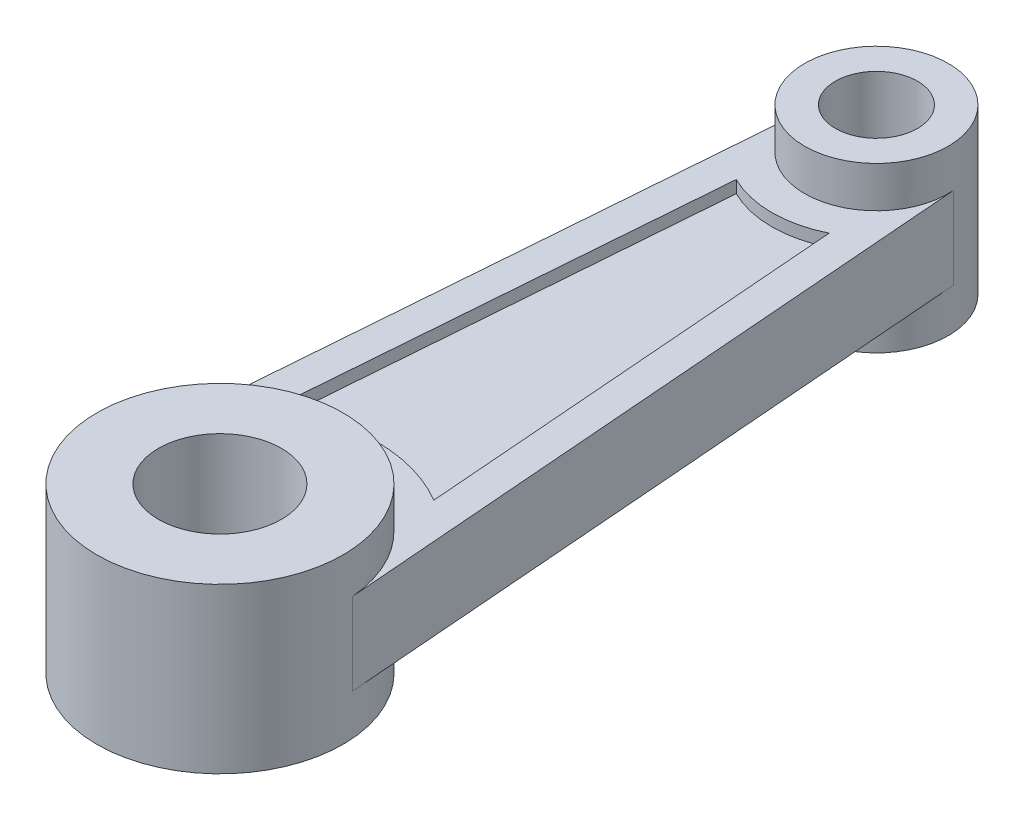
ISO-10303-21;
HEADER;
FILE_DESCRIPTION(('STEP AP214'),'2;1');
FILE_NAME('part.step','',(''),(''),'','','');
FILE_SCHEMA(('AUTOMOTIVE_DESIGN { 1 0 10303 214 1 1 1 1 }'));
ENDSEC;
DATA;
#1=APPLICATION_CONTEXT('core data for automotive mechanical design processes');
#2=APPLICATION_PROTOCOL_DEFINITION('international standard','automotive_design',2000,#1);
#3=PRODUCT_CONTEXT('',#1,'mechanical');
#4=PRODUCT('Part','Part','',(#3));
#5=PRODUCT_RELATED_PRODUCT_CATEGORY('part','',(#4));
#6=PRODUCT_DEFINITION_FORMATION('','',#4);
#7=PRODUCT_DEFINITION_CONTEXT('part definition',#1,'design');
#8=PRODUCT_DEFINITION('design','',#6,#7);
#9=PRODUCT_DEFINITION_SHAPE('','',#8);
#10=(LENGTH_UNIT() NAMED_UNIT(*) SI_UNIT(.MILLI.,.METRE.));
#11=(NAMED_UNIT(*) PLANE_ANGLE_UNIT() SI_UNIT($,.RADIAN.));
#12=(NAMED_UNIT(*) SI_UNIT($,.STERADIAN.) SOLID_ANGLE_UNIT());
#13=UNCERTAINTY_MEASURE_WITH_UNIT(LENGTH_MEASURE(1.E-05),#10,'distance_accuracy_value','');
#14=(GEOMETRIC_REPRESENTATION_CONTEXT(3) GLOBAL_UNCERTAINTY_ASSIGNED_CONTEXT((#13)) GLOBAL_UNIT_ASSIGNED_CONTEXT((#10,
#11,#12)) REPRESENTATION_CONTEXT('',''));
#15=CARTESIAN_POINT('',(0.,0.,0.));
#16=DIRECTION('',(0.,0.,1.));
#17=DIRECTION('',(1.,0.,0.));
#18=AXIS2_PLACEMENT_3D('',#15,#16,#17);
#19=CARTESIAN_POINT('',(-168.150442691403,-10.,-73.75));
#20=DIRECTION('',(0.,1.,0.));
#21=DIRECTION('',(0.,0.,1.));
#22=AXIS2_PLACEMENT_3D('',#19,#20,#21);
#23=PLANE('',#22);
#24=CARTESIAN_POINT('',(0.,-10.,-160.));
#25=DIRECTION('',(0.,1.,0.));
#26=DIRECTION('',(0.,0.,1.));
#27=AXIS2_PLACEMENT_3D('',#24,#25,#26);
#28=CIRCLE('',#27,17.5);
#29=CARTESIAN_POINT('',(-17.4465124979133,-10.,-161.3671875));
#30=VERTEX_POINT('',#29);
#31=CARTESIAN_POINT('',(17.4465124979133,-10.,-161.3671875));
#32=VERTEX_POINT('',#31);
#33=EDGE_CURVE('E201',#30,#32,#28,.T.);
#34=ORIENTED_EDGE('',*,*,#33,.T.);
#35=DIRECTION('',(0.078125,0.,0.99694357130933));
#36=VECTOR('',#35,1.);
#37=CARTESIAN_POINT('',(23.1378898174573,-10.,-88.7402175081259));
#38=LINE('',#37,#36);
#39=CARTESIAN_POINT('',(29.9083071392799,-10.,-2.34375));
#40=VERTEX_POINT('',#39);
#41=EDGE_CURVE('E207',#32,#40,#38,.T.);
#42=ORIENTED_EDGE('',*,*,#41,.T.);
#43=CARTESIAN_POINT('',(0.,-10.,0.));
#44=DIRECTION('',(0.,1.,0.));
#45=DIRECTION('',(0.,0.,1.));
#46=AXIS2_PLACEMENT_3D('',#43,#44,#45);
#47=CIRCLE('',#46,30.);
#48=CARTESIAN_POINT('',(-29.9083071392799,-10.,-2.34375));
#49=VERTEX_POINT('',#48);
#50=EDGE_CURVE('E221',#40,#49,#47,.T.);
#51=ORIENTED_EDGE('',*,*,#50,.T.);
#52=DIRECTION('',(-0.078125,0.,0.99694357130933));
#53=VECTOR('',#52,1.);
#54=CARTESIAN_POINT('',(-25.1905075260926,-10.,-62.5470139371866));
#55=LINE('',#54,#53);
#56=EDGE_CURVE('E218',#30,#49,#55,.T.);
#57=ORIENTED_EDGE('',*,*,#56,.F.);
#58=EDGE_LOOP('',(#34,#42,#51,#57));
#59=FACE_BOUND('',#58,.T.);
#60=CARTESIAN_POINT('',(0.,-10.,-160.));
#61=DIRECTION('',(0.,-1.,0.));
#62=DIRECTION('',(0.,0.,1.));
#63=AXIS2_PLACEMENT_3D('',#60,#61,#62);
#64=CIRCLE('',#63,25.5);
#65=CARTESIAN_POINT('',(11.3197388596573,-10.,-137.150196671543));
#66=VERTEX_POINT('',#65);
#67=CARTESIAN_POINT('',(-11.3197388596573,-10.,-137.150196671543));
#68=VERTEX_POINT('',#67);
#69=EDGE_CURVE('E49',#66,#68,#64,.T.);
#70=ORIENTED_EDGE('',*,*,#69,.T.);
#71=DIRECTION('',(-0.0781249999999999,0.,0.996943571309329));
#72=VECTOR('',#71,1.);
#73=CARTESIAN_POINT('',(-11.3197388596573,-10.,-137.150196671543));
#74=LINE('',#73,#72);
#75=CARTESIAN_POINT('',(-19.5121439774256,-10.,-32.6079167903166));
#76=VERTEX_POINT('',#75);
#77=EDGE_CURVE('E143',#68,#76,#74,.T.);
#78=ORIENTED_EDGE('',*,*,#77,.T.);
#79=CARTESIAN_POINT('',(0.,-10.,0.));
#80=DIRECTION('',(0.,-1.,0.));
#81=DIRECTION('',(0.,0.,1.));
#82=AXIS2_PLACEMENT_3D('',#79,#80,#81);
#83=CIRCLE('',#82,38.);
#84=CARTESIAN_POINT('',(19.5121439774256,-10.,-32.6079167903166));
#85=VERTEX_POINT('',#84);
#86=EDGE_CURVE('E146',#76,#85,#83,.T.);
#87=ORIENTED_EDGE('',*,*,#86,.T.);
#88=DIRECTION('',(-0.078125,0.,-0.996943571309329));
#89=VECTOR('',#88,1.);
#90=CARTESIAN_POINT('',(19.5121439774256,-10.,-32.6079167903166));
#91=LINE('',#90,#89);
#92=EDGE_CURVE('E152',#85,#66,#91,.T.);
#93=ORIENTED_EDGE('',*,*,#92,.T.);
#94=EDGE_LOOP('',(#70,#78,#87,#93));
#95=FACE_BOUND('',#94,.T.);
#96=ADVANCED_FACE('F32',(#59,#95),#23,.F.);
#97=CARTESIAN_POINT('',(0.,20.,0.));
#98=DIRECTION('',(0.,-1.,0.));
#99=DIRECTION('',(0.,0.,-1.));
#100=AXIS2_PLACEMENT_3D('',#97,#98,#99);
#101=CYLINDRICAL_SURFACE('',#100,15.);
#102=CARTESIAN_POINT('',(0.,20.,0.));
#103=DIRECTION('',(0.,1.,0.));
#104=DIRECTION('',(0.,0.,1.));
#105=AXIS2_PLACEMENT_3D('',#102,#103,#104);
#106=CIRCLE('',#105,15.);
#107=CARTESIAN_POINT('',(0.,20.,15.));
#108=VERTEX_POINT('',#107);
#109=EDGE_CURVE('E41',#108,#108,#106,.T.);
#110=ORIENTED_EDGE('',*,*,#109,.T.);
#111=EDGE_LOOP('',(#110));
#112=FACE_BOUND('',#111,.T.);
#113=CARTESIAN_POINT('',(0.,-20.,0.));
#114=DIRECTION('',(0.,1.,0.));
#115=DIRECTION('',(0.,0.,1.));
#116=AXIS2_PLACEMENT_3D('',#113,#114,#115);
#117=CIRCLE('',#116,15.);
#118=CARTESIAN_POINT('',(0.,-20.,15.));
#119=VERTEX_POINT('',#118);
#120=EDGE_CURVE('E235',#119,#119,#117,.T.);
#121=ORIENTED_EDGE('',*,*,#120,.F.);
#122=EDGE_LOOP('',(#121));
#123=FACE_BOUND('',#122,.T.);
#124=ADVANCED_FACE('F34',(#112,#123),#101,.F.);
#125=CARTESIAN_POINT('',(0.,20.,0.));
#126=DIRECTION('',(0.,-1.,0.));
#127=DIRECTION('',(0.,0.,-1.));
#128=AXIS2_PLACEMENT_3D('',#125,#126,#127);
#129=CYLINDRICAL_SURFACE('',#128,30.);
#130=DIRECTION('',(0.,-1.,0.));
#131=VECTOR('',#130,1.);
#132=CARTESIAN_POINT('',(29.9083071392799,10.,-2.34375000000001));
#133=LINE('',#132,#131);
#134=CARTESIAN_POINT('',(29.9083071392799,10.,-2.34375));
#135=VERTEX_POINT('',#134);
#136=EDGE_CURVE('E227',#135,#40,#133,.T.);
#137=ORIENTED_EDGE('',*,*,#136,.F.);
#138=CARTESIAN_POINT('',(0.,10.,0.));
#139=DIRECTION('',(0.,1.,0.));
#140=DIRECTION('',(0.,0.,1.));
#141=AXIS2_PLACEMENT_3D('',#138,#139,#140);
#142=CIRCLE('',#141,30.);
#143=CARTESIAN_POINT('',(-29.9083071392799,10.,-2.34375));
#144=VERTEX_POINT('',#143);
#145=EDGE_CURVE('E210',#135,#144,#142,.T.);
#146=ORIENTED_EDGE('',*,*,#145,.T.);
#147=DIRECTION('',(0.,-1.,0.));
#148=VECTOR('',#147,1.);
#149=CARTESIAN_POINT('',(-29.9083071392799,10.,-2.34375));
#150=LINE('',#149,#148);
#151=EDGE_CURVE('E230',#144,#49,#150,.T.);
#152=ORIENTED_EDGE('',*,*,#151,.T.);
#153=ORIENTED_EDGE('',*,*,#50,.F.);
#154=EDGE_LOOP('',(#137,#146,#152,#153));
#155=FACE_BOUND('',#154,.T.);
#156=CARTESIAN_POINT('',(0.,20.,0.));
#157=DIRECTION('',(0.,1.,0.));
#158=DIRECTION('',(0.,0.,1.));
#159=AXIS2_PLACEMENT_3D('',#156,#157,#158);
#160=CIRCLE('',#159,30.);
#161=CARTESIAN_POINT('',(0.,20.,30.));
#162=VERTEX_POINT('',#161);
#163=EDGE_CURVE('E11',#162,#162,#160,.T.);
#164=ORIENTED_EDGE('',*,*,#163,.F.);
#165=EDGE_LOOP('',(#164));
#166=FACE_BOUND('',#165,.T.);
#167=CARTESIAN_POINT('',(0.,-20.,0.));
#168=DIRECTION('',(0.,1.,0.));
#169=DIRECTION('',(0.,0.,1.));
#170=AXIS2_PLACEMENT_3D('',#167,#168,#169);
#171=CIRCLE('',#170,30.);
#172=CARTESIAN_POINT('',(0.,-20.,30.));
#173=VERTEX_POINT('',#172);
#174=EDGE_CURVE('E36',#173,#173,#171,.T.);
#175=ORIENTED_EDGE('',*,*,#174,.T.);
#176=EDGE_LOOP('',(#175));
#177=FACE_BOUND('',#176,.T.);
#178=ADVANCED_FACE('F243',(#155,#166,#177),#129,.T.);
#179=CARTESIAN_POINT('',(-168.150442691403,20.,-73.75));
#180=DIRECTION('',(0.,1.,0.));
#181=DIRECTION('',(0.,0.,1.));
#182=AXIS2_PLACEMENT_3D('',#179,#180,#181);
#183=PLANE('',#182);
#184=ORIENTED_EDGE('',*,*,#109,.F.);
#185=EDGE_LOOP('',(#184));
#186=FACE_BOUND('',#185,.T.);
#187=ORIENTED_EDGE('',*,*,#163,.T.);
#188=EDGE_LOOP('',(#187));
#189=FACE_BOUND('',#188,.T.);
#190=ADVANCED_FACE('F248',(#186,#189),#183,.T.);
#191=CARTESIAN_POINT('',(-168.150442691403,-20.,-73.75));
#192=DIRECTION('',(0.,1.,0.));
#193=DIRECTION('',(0.,0.,1.));
#194=AXIS2_PLACEMENT_3D('',#191,#192,#193);
#195=PLANE('',#194);
#196=ORIENTED_EDGE('',*,*,#120,.T.);
#197=EDGE_LOOP('',(#196));
#198=FACE_BOUND('',#197,.T.);
#199=ORIENTED_EDGE('',*,*,#174,.F.);
#200=EDGE_LOOP('',(#199));
#201=FACE_BOUND('',#200,.T.);
#202=ADVANCED_FACE('F245',(#198,#201),#195,.F.);
#203=CARTESIAN_POINT('',(-25.1905075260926,10.,-62.5470139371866));
#204=DIRECTION('',(0.996943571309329,0.,0.078125));
#205=DIRECTION('',(0.078125,0.,-0.996943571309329));
#206=AXIS2_PLACEMENT_3D('',#203,#204,#205);
#207=PLANE('',#206);
#208=ORIENTED_EDGE('',*,*,#56,.T.);
#209=ORIENTED_EDGE('',*,*,#151,.F.);
#210=DIRECTION('',(-0.078125,0.,0.99694357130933));
#211=VECTOR('',#210,1.);
#212=CARTESIAN_POINT('',(-25.1905075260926,10.,-62.5470139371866));
#213=LINE('',#212,#211);
#214=CARTESIAN_POINT('',(-17.4465124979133,10.,-161.3671875));
#215=VERTEX_POINT('',#214);
#216=EDGE_CURVE('E206',#215,#144,#213,.T.);
#217=ORIENTED_EDGE('',*,*,#216,.F.);
#218=DIRECTION('',(0.,-1.,0.));
#219=VECTOR('',#218,1.);
#220=CARTESIAN_POINT('',(-17.4465124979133,10.,-161.3671875));
#221=LINE('',#220,#219);
#222=EDGE_CURVE('E232',#215,#30,#221,.T.);
#223=ORIENTED_EDGE('',*,*,#222,.T.);
#224=EDGE_LOOP('',(#208,#209,#217,#223));
#225=FACE_BOUND('',#224,.T.);
#226=ADVANCED_FACE('F247',(#225),#207,.F.);
#227=CARTESIAN_POINT('',(23.1378898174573,10.,-88.7402175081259));
#228=DIRECTION('',(0.996943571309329,0.,-0.078125));
#229=DIRECTION('',(-0.078125,0.,-0.996943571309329));
#230=AXIS2_PLACEMENT_3D('',#227,#228,#229);
#231=PLANE('',#230);
#232=ORIENTED_EDGE('',*,*,#41,.F.);
#233=DIRECTION('',(0.,-1.,0.));
#234=VECTOR('',#233,1.);
#235=CARTESIAN_POINT('',(17.4465124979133,10.,-161.3671875));
#236=LINE('',#235,#234);
#237=CARTESIAN_POINT('',(17.4465124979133,10.,-161.3671875));
#238=VERTEX_POINT('',#237);
#239=EDGE_CURVE('E215',#238,#32,#236,.T.);
#240=ORIENTED_EDGE('',*,*,#239,.F.);
#241=DIRECTION('',(0.078125,0.,0.99694357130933));
#242=VECTOR('',#241,1.);
#243=CARTESIAN_POINT('',(23.1378898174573,10.,-88.7402175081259));
#244=LINE('',#243,#242);
#245=EDGE_CURVE('E212',#238,#135,#244,.T.);
#246=ORIENTED_EDGE('',*,*,#245,.T.);
#247=ORIENTED_EDGE('',*,*,#136,.T.);
#248=EDGE_LOOP('',(#232,#240,#246,#247));
#249=FACE_BOUND('',#248,.T.);
#250=ADVANCED_FACE('F254',(#249),#231,.T.);
#251=CARTESIAN_POINT('',(-168.150442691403,10.,-73.75));
#252=DIRECTION('',(0.,1.,0.));
#253=DIRECTION('',(0.,0.,1.));
#254=AXIS2_PLACEMENT_3D('',#251,#252,#253);
#255=PLANE('',#254);
#256=CARTESIAN_POINT('',(0.,10.,-160.));
#257=DIRECTION('',(0.,-1.,0.));
#258=DIRECTION('',(0.,0.,1.));
#259=AXIS2_PLACEMENT_3D('',#256,#257,#258);
#260=CIRCLE('',#259,25.5);
#261=CARTESIAN_POINT('',(11.3197388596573,10.,-137.150196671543));
#262=VERTEX_POINT('',#261);
#263=CARTESIAN_POINT('',(-11.3197388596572,10.,-137.150196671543));
#264=VERTEX_POINT('',#263);
#265=EDGE_CURVE('E57',#262,#264,#260,.T.);
#266=ORIENTED_EDGE('',*,*,#265,.F.);
#267=DIRECTION('',(-0.078125,0.,-0.996943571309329));
#268=VECTOR('',#267,1.);
#269=CARTESIAN_POINT('',(19.5121439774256,10.,-32.6079167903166));
#270=LINE('',#269,#268);
#271=CARTESIAN_POINT('',(19.5121439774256,10.,-32.6079167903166));
#272=VERTEX_POINT('',#271);
#273=EDGE_CURVE('E165',#272,#262,#270,.T.);
#274=ORIENTED_EDGE('',*,*,#273,.F.);
#275=CARTESIAN_POINT('',(0.,10.,0.));
#276=DIRECTION('',(0.,-1.,0.));
#277=DIRECTION('',(0.,0.,1.));
#278=AXIS2_PLACEMENT_3D('',#275,#276,#277);
#279=CIRCLE('',#278,38.);
#280=CARTESIAN_POINT('',(-19.5121439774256,10.,-32.6079167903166));
#281=VERTEX_POINT('',#280);
#282=EDGE_CURVE('E179',#281,#272,#279,.T.);
#283=ORIENTED_EDGE('',*,*,#282,.F.);
#284=DIRECTION('',(-0.0781249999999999,0.,0.996943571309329));
#285=VECTOR('',#284,1.);
#286=CARTESIAN_POINT('',(-11.3197388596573,10.,-137.150196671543));
#287=LINE('',#286,#285);
#288=EDGE_CURVE('E176',#264,#281,#287,.T.);
#289=ORIENTED_EDGE('',*,*,#288,.F.);
#290=EDGE_LOOP('',(#266,#274,#283,#289));
#291=FACE_BOUND('',#290,.T.);
#292=CARTESIAN_POINT('',(0.,10.,-160.));
#293=DIRECTION('',(0.,1.,0.));
#294=DIRECTION('',(0.,0.,1.));
#295=AXIS2_PLACEMENT_3D('',#292,#293,#294);
#296=CIRCLE('',#295,17.5);
#297=EDGE_CURVE('E204',#215,#238,#296,.T.);
#298=ORIENTED_EDGE('',*,*,#297,.F.);
#299=ORIENTED_EDGE('',*,*,#216,.T.);
#300=ORIENTED_EDGE('',*,*,#145,.F.);
#301=ORIENTED_EDGE('',*,*,#245,.F.);
#302=EDGE_LOOP('',(#298,#299,#300,#301));
#303=FACE_BOUND('',#302,.T.);
#304=ADVANCED_FACE('F269',(#291,#303),#255,.T.);
#305=CARTESIAN_POINT('',(0.,20.,-160.));
#306=DIRECTION('',(0.,-1.,0.));
#307=DIRECTION('',(0.,0.,-1.));
#308=AXIS2_PLACEMENT_3D('',#305,#306,#307);
#309=CYLINDRICAL_SURFACE('',#308,17.5);
#310=ORIENTED_EDGE('',*,*,#297,.T.);
#311=ORIENTED_EDGE('',*,*,#239,.T.);
#312=ORIENTED_EDGE('',*,*,#33,.F.);
#313=ORIENTED_EDGE('',*,*,#222,.F.);
#314=EDGE_LOOP('',(#310,#311,#312,#313));
#315=FACE_BOUND('',#314,.T.);
#316=CARTESIAN_POINT('',(0.,20.,-160.));
#317=DIRECTION('',(0.,1.,0.));
#318=DIRECTION('',(0.,0.,1.));
#319=AXIS2_PLACEMENT_3D('',#316,#317,#318);
#320=CIRCLE('',#319,17.5);
#321=CARTESIAN_POINT('',(0.,20.,-142.5));
#322=VERTEX_POINT('',#321);
#323=EDGE_CURVE('E195',#322,#322,#320,.T.);
#324=ORIENTED_EDGE('',*,*,#323,.F.);
#325=EDGE_LOOP('',(#324));
#326=FACE_BOUND('',#325,.T.);
#327=CARTESIAN_POINT('',(0.,-20.,-160.));
#328=DIRECTION('',(0.,1.,0.));
#329=DIRECTION('',(0.,0.,1.));
#330=AXIS2_PLACEMENT_3D('',#327,#328,#329);
#331=CIRCLE('',#330,17.5);
#332=CARTESIAN_POINT('',(0.,-20.,-142.5));
#333=VERTEX_POINT('',#332);
#334=EDGE_CURVE('E198',#333,#333,#331,.T.);
#335=ORIENTED_EDGE('',*,*,#334,.T.);
#336=EDGE_LOOP('',(#335));
#337=FACE_BOUND('',#336,.T.);
#338=ADVANCED_FACE('F276',(#315,#326,#337),#309,.T.);
#339=CARTESIAN_POINT('',(0.,20.,-160.));
#340=DIRECTION('',(0.,1.,0.));
#341=DIRECTION('',(0.,0.,1.));
#342=AXIS2_PLACEMENT_3D('',#339,#340,#341);
#343=PLANE('',#342);
#344=CARTESIAN_POINT('',(0.,20.,-160.));
#345=DIRECTION('',(0.,1.,0.));
#346=DIRECTION('',(0.,0.,1.));
#347=AXIS2_PLACEMENT_3D('',#344,#345,#346);
#348=CIRCLE('',#347,10.);
#349=CARTESIAN_POINT('',(0.,20.,-150.));
#350=VERTEX_POINT('',#349);
#351=EDGE_CURVE('E186',#350,#350,#348,.T.);
#352=ORIENTED_EDGE('',*,*,#351,.F.);
#353=EDGE_LOOP('',(#352));
#354=FACE_BOUND('',#353,.T.);
#355=ORIENTED_EDGE('',*,*,#323,.T.);
#356=EDGE_LOOP('',(#355));
#357=FACE_BOUND('',#356,.T.);
#358=ADVANCED_FACE('F319',(#354,#357),#343,.T.);
#359=CARTESIAN_POINT('',(0.,-20.,-160.));
#360=DIRECTION('',(0.,1.,0.));
#361=DIRECTION('',(0.,0.,1.));
#362=AXIS2_PLACEMENT_3D('',#359,#360,#361);
#363=PLANE('',#362);
#364=CARTESIAN_POINT('',(0.,-20.,-160.));
#365=DIRECTION('',(0.,1.,0.));
#366=DIRECTION('',(0.,0.,1.));
#367=AXIS2_PLACEMENT_3D('',#364,#365,#366);
#368=CIRCLE('',#367,10.);
#369=CARTESIAN_POINT('',(0.,-20.,-150.));
#370=VERTEX_POINT('',#369);
#371=EDGE_CURVE('E192',#370,#370,#368,.T.);
#372=ORIENTED_EDGE('',*,*,#371,.T.);
#373=EDGE_LOOP('',(#372));
#374=FACE_BOUND('',#373,.T.);
#375=ORIENTED_EDGE('',*,*,#334,.F.);
#376=EDGE_LOOP('',(#375));
#377=FACE_BOUND('',#376,.T.);
#378=ADVANCED_FACE('F327',(#374,#377),#363,.F.);
#379=CARTESIAN_POINT('',(0.,-20.,-160.));
#380=DIRECTION('',(0.,1.,0.));
#381=DIRECTION('',(0.,0.,1.));
#382=AXIS2_PLACEMENT_3D('',#379,#380,#381);
#383=CYLINDRICAL_SURFACE('',#382,10.);
#384=ORIENTED_EDGE('',*,*,#371,.F.);
#385=EDGE_LOOP('',(#384));
#386=FACE_BOUND('',#385,.T.);
#387=ORIENTED_EDGE('',*,*,#351,.T.);
#388=EDGE_LOOP('',(#387));
#389=FACE_BOUND('',#388,.T.);
#390=ADVANCED_FACE('F335',(#386,#389),#383,.F.);
#391=CARTESIAN_POINT('',(0.,7.,-160.));
#392=DIRECTION('',(0.,1.,0.));
#393=DIRECTION('',(0.,0.,1.));
#394=AXIS2_PLACEMENT_3D('',#391,#392,#393);
#395=CYLINDRICAL_SURFACE('',#394,25.5);
#396=ORIENTED_EDGE('',*,*,#265,.T.);
#397=DIRECTION('',(0.,1.,0.));
#398=VECTOR('',#397,1.);
#399=CARTESIAN_POINT('',(-11.3197388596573,7.,-137.150196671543));
#400=LINE('',#399,#398);
#401=CARTESIAN_POINT('',(-11.3197388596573,7.,-137.150196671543));
#402=VERTEX_POINT('',#401);
#403=EDGE_CURVE('E174',#402,#264,#400,.T.);
#404=ORIENTED_EDGE('',*,*,#403,.F.);
#405=CARTESIAN_POINT('',(0.,7.,-160.));
#406=DIRECTION('',(0.,-1.,0.));
#407=DIRECTION('',(0.,0.,1.));
#408=AXIS2_PLACEMENT_3D('',#405,#406,#407);
#409=CIRCLE('',#408,25.5);
#410=CARTESIAN_POINT('',(11.3197388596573,7.,-137.150196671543));
#411=VERTEX_POINT('',#410);
#412=EDGE_CURVE('E161',#411,#402,#409,.T.);
#413=ORIENTED_EDGE('',*,*,#412,.F.);
#414=DIRECTION('',(0.,1.,0.));
#415=VECTOR('',#414,1.);
#416=CARTESIAN_POINT('',(11.3197388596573,7.,-137.150196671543));
#417=LINE('',#416,#415);
#418=EDGE_CURVE('E184',#411,#262,#417,.T.);
#419=ORIENTED_EDGE('',*,*,#418,.T.);
#420=EDGE_LOOP('',(#396,#404,#413,#419));
#421=FACE_BOUND('',#420,.T.);
#422=ADVANCED_FACE('F361',(#421),#395,.T.);
#423=CARTESIAN_POINT('',(19.5121439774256,7.,-32.6079167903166));
#424=DIRECTION('',(0.996943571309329,0.,-0.078125));
#425=DIRECTION('',(-0.078125,0.,-0.99694357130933));
#426=AXIS2_PLACEMENT_3D('',#423,#424,#425);
#427=PLANE('',#426);
#428=ORIENTED_EDGE('',*,*,#273,.T.);
#429=ORIENTED_EDGE('',*,*,#418,.F.);
#430=DIRECTION('',(-0.078125,0.,-0.996943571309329));
#431=VECTOR('',#430,1.);
#432=CARTESIAN_POINT('',(19.5121439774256,7.,-32.6079167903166));
#433=LINE('',#432,#431);
#434=CARTESIAN_POINT('',(19.5121439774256,7.,-32.6079167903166));
#435=VERTEX_POINT('',#434);
#436=EDGE_CURVE('E171',#435,#411,#433,.T.);
#437=ORIENTED_EDGE('',*,*,#436,.F.);
#438=DIRECTION('',(0.,1.,0.));
#439=VECTOR('',#438,1.);
#440=CARTESIAN_POINT('',(19.5121439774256,7.,-32.6079167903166));
#441=LINE('',#440,#439);
#442=EDGE_CURVE('E187',#435,#272,#441,.T.);
#443=ORIENTED_EDGE('',*,*,#442,.T.);
#444=EDGE_LOOP('',(#428,#429,#437,#443));
#445=FACE_BOUND('',#444,.T.);
#446=ADVANCED_FACE('F369',(#445),#427,.F.);
#447=CARTESIAN_POINT('',(0.,7.,0.));
#448=DIRECTION('',(0.,1.,0.));
#449=DIRECTION('',(0.,0.,1.));
#450=AXIS2_PLACEMENT_3D('',#447,#448,#449);
#451=CYLINDRICAL_SURFACE('',#450,38.);
#452=ORIENTED_EDGE('',*,*,#282,.T.);
#453=ORIENTED_EDGE('',*,*,#442,.F.);
#454=CARTESIAN_POINT('',(0.,7.,0.));
#455=DIRECTION('',(0.,-1.,0.));
#456=DIRECTION('',(0.,0.,1.));
#457=AXIS2_PLACEMENT_3D('',#454,#455,#456);
#458=CIRCLE('',#457,38.);
#459=CARTESIAN_POINT('',(-19.5121439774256,7.,-32.6079167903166));
#460=VERTEX_POINT('',#459);
#461=EDGE_CURVE('E168',#460,#435,#458,.T.);
#462=ORIENTED_EDGE('',*,*,#461,.F.);
#463=DIRECTION('',(0.,1.,0.));
#464=VECTOR('',#463,1.);
#465=CARTESIAN_POINT('',(-19.5121439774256,7.,-32.6079167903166));
#466=LINE('',#465,#464);
#467=EDGE_CURVE('E189',#460,#281,#466,.T.);
#468=ORIENTED_EDGE('',*,*,#467,.T.);
#469=EDGE_LOOP('',(#452,#453,#462,#468));
#470=FACE_BOUND('',#469,.T.);
#471=ADVANCED_FACE('F377',(#470),#451,.T.);
#472=CARTESIAN_POINT('',(-11.3197388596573,7.,-137.150196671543));
#473=DIRECTION('',(-0.99694357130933,0.,-0.0781249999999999));
#474=DIRECTION('',(-0.0781249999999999,0.,0.99694357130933));
#475=AXIS2_PLACEMENT_3D('',#472,#473,#474);
#476=PLANE('',#475);
#477=ORIENTED_EDGE('',*,*,#288,.T.);
#478=ORIENTED_EDGE('',*,*,#467,.F.);
#479=DIRECTION('',(-0.0781249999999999,0.,0.996943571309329));
#480=VECTOR('',#479,1.);
#481=CARTESIAN_POINT('',(-11.3197388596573,7.,-137.150196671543));
#482=LINE('',#481,#480);
#483=EDGE_CURVE('E164',#402,#460,#482,.T.);
#484=ORIENTED_EDGE('',*,*,#483,.F.);
#485=ORIENTED_EDGE('',*,*,#403,.T.);
#486=EDGE_LOOP('',(#477,#478,#484,#485));
#487=FACE_BOUND('',#486,.T.);
#488=ADVANCED_FACE('F386',(#487),#476,.F.);
#489=CARTESIAN_POINT('',(0.,7.,-160.));
#490=DIRECTION('',(0.,1.,0.));
#491=DIRECTION('',(0.,0.,1.));
#492=AXIS2_PLACEMENT_3D('',#489,#490,#491);
#493=PLANE('',#492);
#494=ORIENTED_EDGE('',*,*,#412,.T.);
#495=ORIENTED_EDGE('',*,*,#483,.T.);
#496=ORIENTED_EDGE('',*,*,#461,.T.);
#497=ORIENTED_EDGE('',*,*,#436,.T.);
#498=EDGE_LOOP('',(#494,#495,#496,#497));
#499=FACE_BOUND('',#498,.T.);
#500=ADVANCED_FACE('F395',(#499),#493,.T.);
#501=CARTESIAN_POINT('',(0.,-7.,-160.));
#502=DIRECTION('',(0.,-1.,0.));
#503=DIRECTION('',(0.,0.,-1.));
#504=AXIS2_PLACEMENT_3D('',#501,#502,#503);
#505=CYLINDRICAL_SURFACE('',#504,25.5);
#506=ORIENTED_EDGE('',*,*,#69,.F.);
#507=DIRECTION('',(0.,-1.,0.));
#508=VECTOR('',#507,1.);
#509=CARTESIAN_POINT('',(11.3197388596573,-7.,-137.150196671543));
#510=LINE('',#509,#508);
#511=CARTESIAN_POINT('',(11.3197388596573,-7.,-137.150196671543));
#512=VERTEX_POINT('',#511);
#513=EDGE_CURVE('E128',#512,#66,#510,.T.);
#514=ORIENTED_EDGE('',*,*,#513,.F.);
#515=CARTESIAN_POINT('',(0.,-7.,-160.));
#516=DIRECTION('',(0.,-1.,0.));
#517=DIRECTION('',(0.,0.,1.));
#518=AXIS2_PLACEMENT_3D('',#515,#516,#517);
#519=CIRCLE('',#518,25.5);
#520=CARTESIAN_POINT('',(-11.3197388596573,-7.,-137.150196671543));
#521=VERTEX_POINT('',#520);
#522=EDGE_CURVE('E135',#512,#521,#519,.T.);
#523=ORIENTED_EDGE('',*,*,#522,.T.);
#524=DIRECTION('',(0.,-1.,0.));
#525=VECTOR('',#524,1.);
#526=CARTESIAN_POINT('',(-11.3197388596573,-7.,-137.150196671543));
#527=LINE('',#526,#525);
#528=EDGE_CURVE('E156',#521,#68,#527,.T.);
#529=ORIENTED_EDGE('',*,*,#528,.T.);
#530=EDGE_LOOP('',(#506,#514,#523,#529));
#531=FACE_BOUND('',#530,.T.);
#532=ADVANCED_FACE('F138',(#531),#505,.T.);
#533=CARTESIAN_POINT('',(-11.3197388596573,-7.,-137.150196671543));
#534=DIRECTION('',(0.99694357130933,0.,0.0781249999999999));
#535=DIRECTION('',(0.0781249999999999,0.,-0.99694357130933));
#536=AXIS2_PLACEMENT_3D('',#533,#534,#535);
#537=PLANE('',#536);
#538=ORIENTED_EDGE('',*,*,#77,.F.);
#539=ORIENTED_EDGE('',*,*,#528,.F.);
#540=DIRECTION('',(-0.0781249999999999,0.,0.996943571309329));
#541=VECTOR('',#540,1.);
#542=CARTESIAN_POINT('',(-11.3197388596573,-7.,-137.150196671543));
#543=LINE('',#542,#541);
#544=CARTESIAN_POINT('',(-19.5121439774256,-7.,-32.6079167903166));
#545=VERTEX_POINT('',#544);
#546=EDGE_CURVE('E140',#521,#545,#543,.T.);
#547=ORIENTED_EDGE('',*,*,#546,.T.);
#548=DIRECTION('',(0.,-1.,0.));
#549=VECTOR('',#548,1.);
#550=CARTESIAN_POINT('',(-19.5121439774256,-7.,-32.6079167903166));
#551=LINE('',#550,#549);
#552=EDGE_CURVE('E158',#545,#76,#551,.T.);
#553=ORIENTED_EDGE('',*,*,#552,.T.);
#554=EDGE_LOOP('',(#538,#539,#547,#553));
#555=FACE_BOUND('',#554,.T.);
#556=ADVANCED_FACE('F419',(#555),#537,.T.);
#557=CARTESIAN_POINT('',(0.,-7.,0.));
#558=DIRECTION('',(0.,-1.,0.));
#559=DIRECTION('',(0.,0.,-1.));
#560=AXIS2_PLACEMENT_3D('',#557,#558,#559);
#561=CYLINDRICAL_SURFACE('',#560,38.);
#562=ORIENTED_EDGE('',*,*,#86,.F.);
#563=ORIENTED_EDGE('',*,*,#552,.F.);
#564=CARTESIAN_POINT('',(0.,-7.,0.));
#565=DIRECTION('',(0.,-1.,0.));
#566=DIRECTION('',(0.,0.,1.));
#567=AXIS2_PLACEMENT_3D('',#564,#565,#566);
#568=CIRCLE('',#567,38.);
#569=CARTESIAN_POINT('',(19.5121439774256,-7.,-32.6079167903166));
#570=VERTEX_POINT('',#569);
#571=EDGE_CURVE('E134',#545,#570,#568,.T.);
#572=ORIENTED_EDGE('',*,*,#571,.T.);
#573=DIRECTION('',(0.,-1.,0.));
#574=VECTOR('',#573,1.);
#575=CARTESIAN_POINT('',(19.5121439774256,-7.,-32.6079167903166));
#576=LINE('',#575,#574);
#577=EDGE_CURVE('E130',#570,#85,#576,.T.);
#578=ORIENTED_EDGE('',*,*,#577,.T.);
#579=EDGE_LOOP('',(#562,#563,#572,#578));
#580=FACE_BOUND('',#579,.T.);
#581=ADVANCED_FACE('F427',(#580),#561,.T.);
#582=CARTESIAN_POINT('',(19.5121439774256,-7.,-32.6079167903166));
#583=DIRECTION('',(-0.996943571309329,0.,0.078125));
#584=DIRECTION('',(0.078125,0.,0.99694357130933));
#585=AXIS2_PLACEMENT_3D('',#582,#583,#584);
#586=PLANE('',#585);
#587=ORIENTED_EDGE('',*,*,#92,.F.);
#588=ORIENTED_EDGE('',*,*,#577,.F.);
#589=DIRECTION('',(-0.078125,0.,-0.996943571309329));
#590=VECTOR('',#589,1.);
#591=CARTESIAN_POINT('',(19.5121439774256,-7.,-32.6079167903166));
#592=LINE('',#591,#590);
#593=EDGE_CURVE('E125',#570,#512,#592,.T.);
#594=ORIENTED_EDGE('',*,*,#593,.T.);
#595=ORIENTED_EDGE('',*,*,#513,.T.);
#596=EDGE_LOOP('',(#587,#588,#594,#595));
#597=FACE_BOUND('',#596,.T.);
#598=ADVANCED_FACE('F127',(#597),#586,.T.);
#599=CARTESIAN_POINT('',(0.,-7.,-160.));
#600=DIRECTION('',(0.,-1.,0.));
#601=DIRECTION('',(0.,0.,1.));
#602=AXIS2_PLACEMENT_3D('',#599,#600,#601);
#603=PLANE('',#602);
#604=ORIENTED_EDGE('',*,*,#522,.F.);
#605=ORIENTED_EDGE('',*,*,#593,.F.);
#606=ORIENTED_EDGE('',*,*,#571,.F.);
#607=ORIENTED_EDGE('',*,*,#546,.F.);
#608=EDGE_LOOP('',(#604,#605,#606,#607));
#609=FACE_BOUND('',#608,.T.);
#610=ADVANCED_FACE('F142',(#609),#603,.T.);
#611=CLOSED_SHELL('',(#96,#124,#178,#190,#202,#226,#250,#304,#338,#358,#378,#390,#422,#446,#471,
#488,#500,#532,#556,#581,#598,#610));
#612=MANIFOLD_SOLID_BREP('B2',#611);
#613=ADVANCED_BREP_SHAPE_REPRESENTATION('',(#18,#612),#14);
#614=SHAPE_DEFINITION_REPRESENTATION(#9,#613);
ENDSEC;
END-ISO-10303-21;
